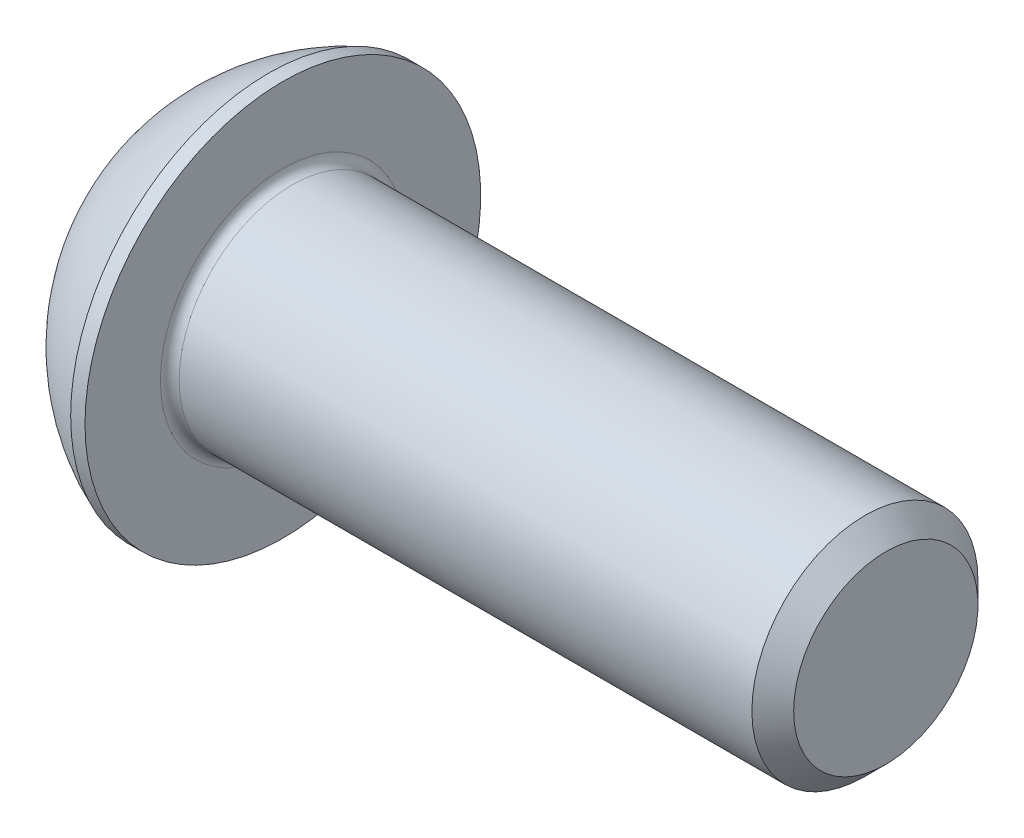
from build123d import *

# Parameters (mm, degrees)
FILLET1_R   = 0.25
HEX_2_DEPTH = 2.08


with BuildPart() as part:
    # BodySke → BaseBody (revolve)
    with BuildSketch(Plane.XY, mode=Mode.PRIVATE) as basebody_sk:
        with BuildLine():
            Line((19.3, 0), (19.3, 2.4455))
            Line((19.3, 2.4455), (18.7455, 3))
            Line((18.7455, 3), (3.3, 3))
            Line((3.3, 3), (3.3, 5.25))
            Line((3.3, 5.25), (2.92, 5.25))
            ThreePointArc((2.92, 5.25), (1.224500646, 4.199464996), (0, 2.625))
            Line((0, 2.625), (0, 0))
            Line((0, 0), (19.3, 0))
        make_face()
    revolve(basebody_sk.sketch.rotate(Axis((0, 0, 0), (1, 0, 0)), 90), axis=Axis((0, 0, 0), (1, 0, 0)))

    # Fillet1
    fillet1_edges = [part.edges().sort_by_distance(p)[0] for p in [
        (3.3, 0, -3),
    ]]
    fillet(fillet1_edges, radius=FILLET1_R)

    # Sketch2 → PreBroach (revolve, cut)
    with BuildSketch(Plane.XY):
        Polygon((0, 2), (2.08, 2), (3.234700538, 0), (0, 0), align=None)
    revolve(axis=Axis((0, 0, 0), (1, 0, 0)), mode=Mode.SUBTRACT)

    # Sketch3 → Hex 2 (cut)
    with BuildSketch(Plane(origin=(0, 0, 0), x_dir=(0, 0, -1), z_dir=(1, 0, 0))):
        Polygon((-2, -1.154700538), (-2, 1.154700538), (0, 2.309401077), (2, 1.154700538), (2, -1.154700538), (0, -2.309401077), align=None)
    extrude(amount=HEX_2_DEPTH, mode=Mode.SUBTRACT)


solid = part.part
